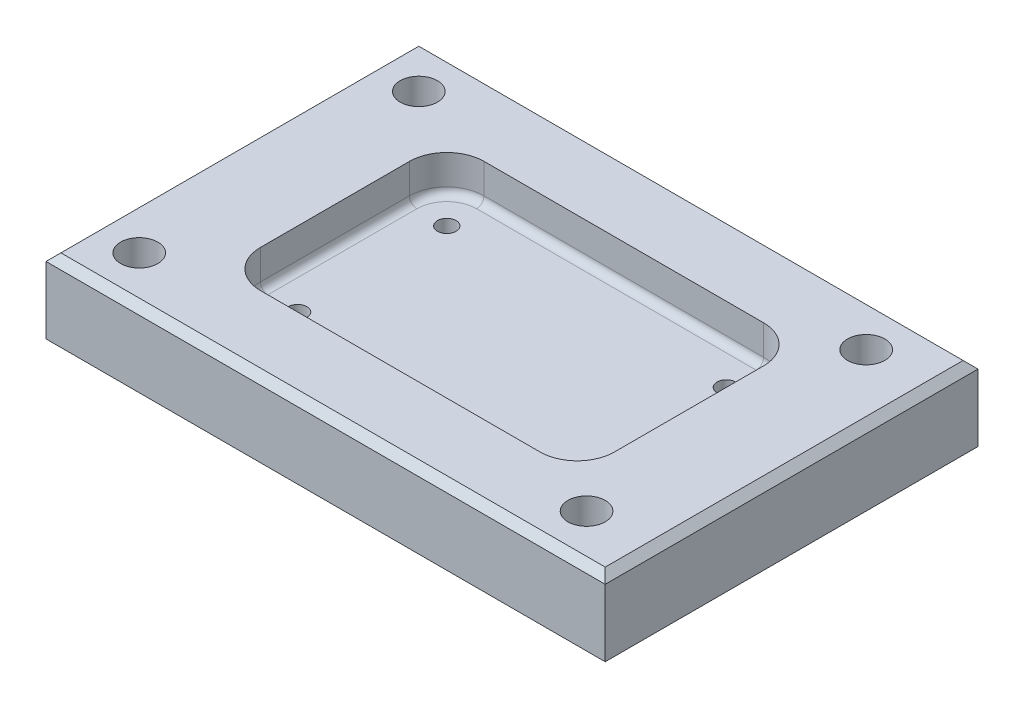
ISO-10303-21;
HEADER;
FILE_DESCRIPTION(('STEP AP214'),'2;1');
FILE_NAME('part.step','',(''),(''),'','','');
FILE_SCHEMA(('AUTOMOTIVE_DESIGN { 1 0 10303 214 1 1 1 1 }'));
ENDSEC;
DATA;
#1=APPLICATION_CONTEXT('core data for automotive mechanical design processes');
#2=APPLICATION_PROTOCOL_DEFINITION('international standard','automotive_design',2000,#1);
#3=PRODUCT_CONTEXT('',#1,'mechanical');
#4=PRODUCT('Part','Part','',(#3));
#5=PRODUCT_RELATED_PRODUCT_CATEGORY('part','',(#4));
#6=PRODUCT_DEFINITION_FORMATION('','',#4);
#7=PRODUCT_DEFINITION_CONTEXT('part definition',#1,'design');
#8=PRODUCT_DEFINITION('design','',#6,#7);
#9=PRODUCT_DEFINITION_SHAPE('','',#8);
#10=(LENGTH_UNIT() NAMED_UNIT(*) SI_UNIT(.MILLI.,.METRE.));
#11=(NAMED_UNIT(*) PLANE_ANGLE_UNIT() SI_UNIT($,.RADIAN.));
#12=(NAMED_UNIT(*) SI_UNIT($,.STERADIAN.) SOLID_ANGLE_UNIT());
#13=UNCERTAINTY_MEASURE_WITH_UNIT(LENGTH_MEASURE(1.E-05),#10,'distance_accuracy_value','');
#14=(GEOMETRIC_REPRESENTATION_CONTEXT(3) GLOBAL_UNCERTAINTY_ASSIGNED_CONTEXT((#13)) GLOBAL_UNIT_ASSIGNED_CONTEXT((#10,
#11,#12)) REPRESENTATION_CONTEXT('',''));
#15=CARTESIAN_POINT('',(0.,0.,0.));
#16=DIRECTION('',(0.,0.,1.));
#17=DIRECTION('',(1.,0.,0.));
#18=AXIS2_PLACEMENT_3D('',#15,#16,#17);
#19=CARTESIAN_POINT('',(-75.,20.,-50.));
#20=DIRECTION('',(1.,0.,0.));
#21=DIRECTION('',(0.,0.,-1.));
#22=AXIS2_PLACEMENT_3D('',#19,#20,#21);
#23=PLANE('',#22);
#24=DIRECTION('',(0.,-1.,0.));
#25=VECTOR('',#24,1.);
#26=CARTESIAN_POINT('',(-75.,20.,50.));
#27=LINE('',#26,#25);
#28=CARTESIAN_POINT('',(-75.,18.,50.));
#29=VERTEX_POINT('',#28);
#30=CARTESIAN_POINT('',(-75.,0.,50.));
#31=VERTEX_POINT('',#30);
#32=EDGE_CURVE('E233',#29,#31,#27,.T.);
#33=ORIENTED_EDGE('',*,*,#32,.F.);
#34=DIRECTION('',(0.,0.,-1.));
#35=VECTOR('',#34,1.);
#36=CARTESIAN_POINT('',(-75.,18.,-50.));
#37=LINE('',#36,#35);
#38=CARTESIAN_POINT('',(-75.,18.,-50.));
#39=VERTEX_POINT('',#38);
#40=EDGE_CURVE('E300',#29,#39,#37,.T.);
#41=ORIENTED_EDGE('',*,*,#40,.T.);
#42=DIRECTION('',(0.,-1.,0.));
#43=VECTOR('',#42,1.);
#44=CARTESIAN_POINT('',(-75.,20.,-50.));
#45=LINE('',#44,#43);
#46=CARTESIAN_POINT('',(-75.,0.,-50.));
#47=VERTEX_POINT('',#46);
#48=EDGE_CURVE('E227',#39,#47,#45,.T.);
#49=ORIENTED_EDGE('',*,*,#48,.T.);
#50=DIRECTION('',(0.,0.,1.));
#51=VECTOR('',#50,1.);
#52=CARTESIAN_POINT('',(-75.,0.,-50.));
#53=LINE('',#52,#51);
#54=EDGE_CURVE('E205',#47,#31,#53,.T.);
#55=ORIENTED_EDGE('',*,*,#54,.T.);
#56=EDGE_LOOP('',(#33,#41,#49,#55));
#57=FACE_BOUND('',#56,.T.);
#58=ADVANCED_FACE('F34',(#57),#23,.F.);
#59=CARTESIAN_POINT('',(-75.,20.,50.));
#60=DIRECTION('',(0.,0.,-1.));
#61=DIRECTION('',(-1.,0.,0.));
#62=AXIS2_PLACEMENT_3D('',#59,#60,#61);
#63=PLANE('',#62);
#64=DIRECTION('',(0.,-1.,0.));
#65=VECTOR('',#64,1.);
#66=CARTESIAN_POINT('',(75.,20.,50.));
#67=LINE('',#66,#65);
#68=CARTESIAN_POINT('',(75.,18.,50.));
#69=VERTEX_POINT('',#68);
#70=CARTESIAN_POINT('',(75.,0.,50.));
#71=VERTEX_POINT('',#70);
#72=EDGE_CURVE('E231',#69,#71,#67,.T.);
#73=ORIENTED_EDGE('',*,*,#72,.F.);
#74=DIRECTION('',(-1.,0.,0.));
#75=VECTOR('',#74,1.);
#76=CARTESIAN_POINT('',(-75.,18.,50.));
#77=LINE('',#76,#75);
#78=EDGE_CURVE('E11',#69,#29,#77,.T.);
#79=ORIENTED_EDGE('',*,*,#78,.T.);
#80=ORIENTED_EDGE('',*,*,#32,.T.);
#81=DIRECTION('',(1.,0.,0.));
#82=VECTOR('',#81,1.);
#83=CARTESIAN_POINT('',(-75.,0.,50.));
#84=LINE('',#83,#82);
#85=EDGE_CURVE('E218',#31,#71,#84,.T.);
#86=ORIENTED_EDGE('',*,*,#85,.T.);
#87=EDGE_LOOP('',(#73,#79,#80,#86));
#88=FACE_BOUND('',#87,.T.);
#89=ADVANCED_FACE('F436',(#88),#63,.F.);
#90=CARTESIAN_POINT('',(75.,20.,-50.));
#91=DIRECTION('',(-1.,0.,0.));
#92=DIRECTION('',(0.,0.,1.));
#93=AXIS2_PLACEMENT_3D('',#90,#91,#92);
#94=PLANE('',#93);
#95=DIRECTION('',(0.,-1.,0.));
#96=VECTOR('',#95,1.);
#97=CARTESIAN_POINT('',(75.,20.,-50.));
#98=LINE('',#97,#96);
#99=CARTESIAN_POINT('',(75.,18.,-50.));
#100=VERTEX_POINT('',#99);
#101=CARTESIAN_POINT('',(75.,0.,-50.));
#102=VERTEX_POINT('',#101);
#103=EDGE_CURVE('E229',#100,#102,#98,.T.);
#104=ORIENTED_EDGE('',*,*,#103,.F.);
#105=DIRECTION('',(0.,0.,1.));
#106=VECTOR('',#105,1.);
#107=CARTESIAN_POINT('',(75.,18.,50.));
#108=LINE('',#107,#106);
#109=EDGE_CURVE('E43',#100,#69,#108,.T.);
#110=ORIENTED_EDGE('',*,*,#109,.T.);
#111=ORIENTED_EDGE('',*,*,#72,.T.);
#112=DIRECTION('',(0.,0.,-1.));
#113=VECTOR('',#112,1.);
#114=CARTESIAN_POINT('',(75.,0.,-50.));
#115=LINE('',#114,#113);
#116=EDGE_CURVE('E221',#71,#102,#115,.T.);
#117=ORIENTED_EDGE('',*,*,#116,.T.);
#118=EDGE_LOOP('',(#104,#110,#111,#117));
#119=FACE_BOUND('',#118,.T.);
#120=ADVANCED_FACE('F442',(#119),#94,.F.);
#121=CARTESIAN_POINT('',(-75.,20.,-50.));
#122=DIRECTION('',(0.,0.,1.));
#123=DIRECTION('',(1.,0.,0.));
#124=AXIS2_PLACEMENT_3D('',#121,#122,#123);
#125=PLANE('',#124);
#126=ORIENTED_EDGE('',*,*,#48,.F.);
#127=DIRECTION('',(1.,0.,0.));
#128=VECTOR('',#127,1.);
#129=CARTESIAN_POINT('',(75.,18.,-50.));
#130=LINE('',#129,#128);
#131=EDGE_CURVE('E58',#39,#100,#130,.T.);
#132=ORIENTED_EDGE('',*,*,#131,.T.);
#133=ORIENTED_EDGE('',*,*,#103,.T.);
#134=DIRECTION('',(-1.,0.,0.));
#135=VECTOR('',#134,1.);
#136=CARTESIAN_POINT('',(-75.,0.,-50.));
#137=LINE('',#136,#135);
#138=EDGE_CURVE('E224',#102,#47,#137,.T.);
#139=ORIENTED_EDGE('',*,*,#138,.T.);
#140=EDGE_LOOP('',(#126,#132,#133,#139));
#141=FACE_BOUND('',#140,.T.);
#142=ADVANCED_FACE('F694',(#141),#125,.F.);
#143=CARTESIAN_POINT('',(-75.,20.,50.));
#144=DIRECTION('',(0.,1.,0.));
#145=DIRECTION('',(0.,0.,1.));
#146=AXIS2_PLACEMENT_3D('',#143,#144,#145);
#147=PLANE('',#146);
#148=DIRECTION('',(-1.,0.,0.));
#149=VECTOR('',#148,1.);
#150=CARTESIAN_POINT('',(-75.,20.,-48.));
#151=LINE('',#150,#149);
#152=CARTESIAN_POINT('',(73.,20.,-48.));
#153=VERTEX_POINT('',#152);
#154=CARTESIAN_POINT('',(-73.,20.,-48.));
#155=VERTEX_POINT('',#154);
#156=EDGE_CURVE('E295',#153,#155,#151,.T.);
#157=ORIENTED_EDGE('',*,*,#156,.T.);
#158=DIRECTION('',(0.,0.,1.));
#159=VECTOR('',#158,1.);
#160=CARTESIAN_POINT('',(-73.,20.,50.));
#161=LINE('',#160,#159);
#162=CARTESIAN_POINT('',(-73.,20.,48.));
#163=VERTEX_POINT('',#162);
#164=EDGE_CURVE('E297',#155,#163,#161,.T.);
#165=ORIENTED_EDGE('',*,*,#164,.T.);
#166=DIRECTION('',(1.,0.,0.));
#167=VECTOR('',#166,1.);
#168=CARTESIAN_POINT('',(75.,20.,48.));
#169=LINE('',#168,#167);
#170=CARTESIAN_POINT('',(73.,20.,48.));
#171=VERTEX_POINT('',#170);
#172=EDGE_CURVE('E268',#163,#171,#169,.T.);
#173=ORIENTED_EDGE('',*,*,#172,.T.);
#174=DIRECTION('',(0.,0.,-1.));
#175=VECTOR('',#174,1.);
#176=CARTESIAN_POINT('',(73.,20.,-50.));
#177=LINE('',#176,#175);
#178=EDGE_CURVE('E293',#171,#153,#177,.T.);
#179=ORIENTED_EDGE('',*,*,#178,.T.);
#180=EDGE_LOOP('',(#157,#165,#173,#179));
#181=FACE_BOUND('',#180,.T.);
#182=CARTESIAN_POINT('',(57.5,20.,-37.5));
#183=DIRECTION('',(0.,1.,0.));
#184=DIRECTION('',(0.,0.,1.));
#185=AXIS2_PLACEMENT_3D('',#182,#183,#184);
#186=CIRCLE('',#185,5.00000000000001);
#187=CARTESIAN_POINT('',(57.5,20.,-32.5));
#188=VERTEX_POINT('',#187);
#189=EDGE_CURVE('E315',#188,#188,#186,.T.);
#190=ORIENTED_EDGE('',*,*,#189,.F.);
#191=EDGE_LOOP('',(#190));
#192=FACE_BOUND('',#191,.T.);
#193=CARTESIAN_POINT('',(-62.5,20.,-37.5));
#194=DIRECTION('',(0.,1.,0.));
#195=DIRECTION('',(0.,0.,1.));
#196=AXIS2_PLACEMENT_3D('',#193,#194,#195);
#197=CIRCLE('',#196,5.00000000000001);
#198=CARTESIAN_POINT('',(-62.5,20.,-32.5));
#199=VERTEX_POINT('',#198);
#200=EDGE_CURVE('E325',#199,#199,#197,.T.);
#201=ORIENTED_EDGE('',*,*,#200,.F.);
#202=EDGE_LOOP('',(#201));
#203=FACE_BOUND('',#202,.T.);
#204=CARTESIAN_POINT('',(57.5,20.,37.5));
#205=DIRECTION('',(0.,1.,0.));
#206=DIRECTION('',(0.,0.,1.));
#207=AXIS2_PLACEMENT_3D('',#204,#205,#206);
#208=CIRCLE('',#207,5.00000000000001);
#209=CARTESIAN_POINT('',(57.5,20.,42.5));
#210=VERTEX_POINT('',#209);
#211=EDGE_CURVE('E331',#210,#210,#208,.T.);
#212=ORIENTED_EDGE('',*,*,#211,.F.);
#213=EDGE_LOOP('',(#212));
#214=FACE_BOUND('',#213,.T.);
#215=CARTESIAN_POINT('',(-62.5,20.,37.5));
#216=DIRECTION('',(0.,1.,0.));
#217=DIRECTION('',(0.,0.,1.));
#218=AXIS2_PLACEMENT_3D('',#215,#216,#217);
#219=CIRCLE('',#218,5.00000000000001);
#220=CARTESIAN_POINT('',(-62.5,20.,42.5));
#221=VERTEX_POINT('',#220);
#222=EDGE_CURVE('E337',#221,#221,#219,.T.);
#223=ORIENTED_EDGE('',*,*,#222,.F.);
#224=EDGE_LOOP('',(#223));
#225=FACE_BOUND('',#224,.T.);
#226=CARTESIAN_POINT('',(-37.5,20.,20.));
#227=DIRECTION('',(0.,1.,0.));
#228=DIRECTION('',(0.,0.,-1.));
#229=AXIS2_PLACEMENT_3D('',#226,#227,#228);
#230=CIRCLE('',#229,10.);
#231=CARTESIAN_POINT('',(-47.5,20.,19.9999999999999));
#232=VERTEX_POINT('',#231);
#233=CARTESIAN_POINT('',(-37.4999999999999,20.,30.));
#234=VERTEX_POINT('',#233);
#235=EDGE_CURVE('E181',#232,#234,#230,.T.);
#236=ORIENTED_EDGE('',*,*,#235,.F.);
#237=DIRECTION('',(0.,0.,1.));
#238=VECTOR('',#237,1.);
#239=CARTESIAN_POINT('',(-47.5,20.,19.9999999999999));
#240=LINE('',#239,#238);
#241=CARTESIAN_POINT('',(-47.5,20.,-19.9999999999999));
#242=VERTEX_POINT('',#241);
#243=EDGE_CURVE('E200',#242,#232,#240,.T.);
#244=ORIENTED_EDGE('',*,*,#243,.F.);
#245=CARTESIAN_POINT('',(-37.5,20.,-20.));
#246=DIRECTION('',(0.,1.,0.));
#247=DIRECTION('',(0.,0.,1.));
#248=AXIS2_PLACEMENT_3D('',#245,#246,#247);
#249=CIRCLE('',#248,10.);
#250=CARTESIAN_POINT('',(-37.4999999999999,20.,-30.));
#251=VERTEX_POINT('',#250);
#252=EDGE_CURVE('E197',#251,#242,#249,.T.);
#253=ORIENTED_EDGE('',*,*,#252,.F.);
#254=DIRECTION('',(-1.,0.,0.));
#255=VECTOR('',#254,1.);
#256=CARTESIAN_POINT('',(37.4999999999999,20.,-30.));
#257=LINE('',#256,#255);
#258=CARTESIAN_POINT('',(37.4999999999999,20.,-30.));
#259=VERTEX_POINT('',#258);
#260=EDGE_CURVE('E194',#259,#251,#257,.T.);
#261=ORIENTED_EDGE('',*,*,#260,.F.);
#262=CARTESIAN_POINT('',(37.5,20.,-20.));
#263=DIRECTION('',(0.,1.,0.));
#264=DIRECTION('',(0.,0.,1.));
#265=AXIS2_PLACEMENT_3D('',#262,#263,#264);
#266=CIRCLE('',#265,10.);
#267=CARTESIAN_POINT('',(47.5,20.,-19.9999999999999));
#268=VERTEX_POINT('',#267);
#269=EDGE_CURVE('E188',#268,#259,#266,.T.);
#270=ORIENTED_EDGE('',*,*,#269,.F.);
#271=DIRECTION('',(0.,0.,-1.));
#272=VECTOR('',#271,1.);
#273=CARTESIAN_POINT('',(47.5,20.,19.9999999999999));
#274=LINE('',#273,#272);
#275=CARTESIAN_POINT('',(47.5,20.,19.9999999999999));
#276=VERTEX_POINT('',#275);
#277=EDGE_CURVE('E186',#276,#268,#274,.T.);
#278=ORIENTED_EDGE('',*,*,#277,.F.);
#279=CARTESIAN_POINT('',(37.5,20.,20.));
#280=DIRECTION('',(0.,1.,0.));
#281=DIRECTION('',(0.,0.,1.));
#282=AXIS2_PLACEMENT_3D('',#279,#280,#281);
#283=CIRCLE('',#282,10.);
#284=CARTESIAN_POINT('',(37.4999999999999,20.,30.));
#285=VERTEX_POINT('',#284);
#286=EDGE_CURVE('E165',#285,#276,#283,.T.);
#287=ORIENTED_EDGE('',*,*,#286,.F.);
#288=DIRECTION('',(1.,0.,0.));
#289=VECTOR('',#288,1.);
#290=CARTESIAN_POINT('',(37.4999999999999,20.,30.));
#291=LINE('',#290,#289);
#292=EDGE_CURVE('E175',#234,#285,#291,.T.);
#293=ORIENTED_EDGE('',*,*,#292,.F.);
#294=EDGE_LOOP('',(#236,#244,#253,#261,#270,#278,#287,#293));
#295=FACE_BOUND('',#294,.T.);
#296=ADVANCED_FACE('F183',(#181,#192,#203,#214,#225,#295),#147,.T.);
#297=CARTESIAN_POINT('',(-75.,0.,50.));
#298=DIRECTION('',(0.,1.,0.));
#299=DIRECTION('',(0.,0.,1.));
#300=AXIS2_PLACEMENT_3D('',#297,#298,#299);
#301=PLANE('',#300);
#302=CARTESIAN_POINT('',(57.5,0.,-37.5));
#303=DIRECTION('',(0.,1.,0.));
#304=DIRECTION('',(0.,0.,1.));
#305=AXIS2_PLACEMENT_3D('',#302,#303,#304);
#306=CIRCLE('',#305,5.00000000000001);
#307=CARTESIAN_POINT('',(57.5,0.,-32.5));
#308=VERTEX_POINT('',#307);
#309=EDGE_CURVE('E320',#308,#308,#306,.T.);
#310=ORIENTED_EDGE('',*,*,#309,.T.);
#311=EDGE_LOOP('',(#310));
#312=FACE_BOUND('',#311,.T.);
#313=CARTESIAN_POINT('',(-62.5,0.,-37.5));
#314=DIRECTION('',(0.,1.,0.));
#315=DIRECTION('',(0.,0.,1.));
#316=AXIS2_PLACEMENT_3D('',#313,#314,#315);
#317=CIRCLE('',#316,5.00000000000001);
#318=CARTESIAN_POINT('',(-62.5,0.,-32.5));
#319=VERTEX_POINT('',#318);
#320=EDGE_CURVE('E328',#319,#319,#317,.T.);
#321=ORIENTED_EDGE('',*,*,#320,.T.);
#322=EDGE_LOOP('',(#321));
#323=FACE_BOUND('',#322,.T.);
#324=CARTESIAN_POINT('',(57.5,0.,37.5));
#325=DIRECTION('',(0.,1.,0.));
#326=DIRECTION('',(0.,0.,1.));
#327=AXIS2_PLACEMENT_3D('',#324,#325,#326);
#328=CIRCLE('',#327,5.00000000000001);
#329=CARTESIAN_POINT('',(57.5,0.,42.5));
#330=VERTEX_POINT('',#329);
#331=EDGE_CURVE('E334',#330,#330,#328,.T.);
#332=ORIENTED_EDGE('',*,*,#331,.T.);
#333=EDGE_LOOP('',(#332));
#334=FACE_BOUND('',#333,.T.);
#335=CARTESIAN_POINT('',(-62.5,0.,37.5));
#336=DIRECTION('',(0.,1.,0.));
#337=DIRECTION('',(0.,0.,1.));
#338=AXIS2_PLACEMENT_3D('',#335,#336,#337);
#339=CIRCLE('',#338,5.00000000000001);
#340=CARTESIAN_POINT('',(-62.5,0.,42.5));
#341=VERTEX_POINT('',#340);
#342=EDGE_CURVE('E340',#341,#341,#339,.T.);
#343=ORIENTED_EDGE('',*,*,#342,.T.);
#344=EDGE_LOOP('',(#343));
#345=FACE_BOUND('',#344,.T.);
#346=CARTESIAN_POINT('',(-37.5,0.,-20.));
#347=DIRECTION('',(0.,1.,0.));
#348=DIRECTION('',(0.,0.,1.));
#349=AXIS2_PLACEMENT_3D('',#346,#347,#348);
#350=CIRCLE('',#349,2.5);
#351=CARTESIAN_POINT('',(-37.5,0.,-17.5));
#352=VERTEX_POINT('',#351);
#353=EDGE_CURVE('E346',#352,#352,#350,.T.);
#354=ORIENTED_EDGE('',*,*,#353,.T.);
#355=EDGE_LOOP('',(#354));
#356=FACE_BOUND('',#355,.T.);
#357=CARTESIAN_POINT('',(-37.5,0.,20.));
#358=DIRECTION('',(0.,1.,0.));
#359=DIRECTION('',(0.,0.,1.));
#360=AXIS2_PLACEMENT_3D('',#357,#358,#359);
#361=CIRCLE('',#360,2.5);
#362=CARTESIAN_POINT('',(-37.5,0.,22.5));
#363=VERTEX_POINT('',#362);
#364=EDGE_CURVE('E352',#363,#363,#361,.T.);
#365=ORIENTED_EDGE('',*,*,#364,.T.);
#366=EDGE_LOOP('',(#365));
#367=FACE_BOUND('',#366,.T.);
#368=CARTESIAN_POINT('',(37.5,0.,-20.));
#369=DIRECTION('',(0.,1.,0.));
#370=DIRECTION('',(0.,0.,1.));
#371=AXIS2_PLACEMENT_3D('',#368,#369,#370);
#372=CIRCLE('',#371,2.5);
#373=CARTESIAN_POINT('',(37.5,0.,-17.5));
#374=VERTEX_POINT('',#373);
#375=EDGE_CURVE('E358',#374,#374,#372,.T.);
#376=ORIENTED_EDGE('',*,*,#375,.T.);
#377=EDGE_LOOP('',(#376));
#378=FACE_BOUND('',#377,.T.);
#379=CARTESIAN_POINT('',(37.5,0.,20.));
#380=DIRECTION('',(0.,1.,0.));
#381=DIRECTION('',(0.,0.,1.));
#382=AXIS2_PLACEMENT_3D('',#379,#380,#381);
#383=CIRCLE('',#382,2.5);
#384=CARTESIAN_POINT('',(37.5,0.,22.5));
#385=VERTEX_POINT('',#384);
#386=EDGE_CURVE('E272',#385,#385,#383,.T.);
#387=ORIENTED_EDGE('',*,*,#386,.T.);
#388=EDGE_LOOP('',(#387));
#389=FACE_BOUND('',#388,.T.);
#390=ORIENTED_EDGE('',*,*,#54,.F.);
#391=ORIENTED_EDGE('',*,*,#138,.F.);
#392=ORIENTED_EDGE('',*,*,#116,.F.);
#393=ORIENTED_EDGE('',*,*,#85,.F.);
#394=EDGE_LOOP('',(#390,#391,#392,#393));
#395=FACE_BOUND('',#394,.T.);
#396=ADVANCED_FACE('F680',(#312,#323,#334,#345,#356,#367,#378,#389,#395),#301,.F.);
#397=CARTESIAN_POINT('',(-37.5,10.,20.));
#398=DIRECTION('',(0.,1.,0.));
#399=DIRECTION('',(0.,0.,1.));
#400=AXIS2_PLACEMENT_3D('',#397,#398,#399);
#401=CYLINDRICAL_SURFACE('',#400,10.);
#402=DIRECTION('',(0.,1.,0.));
#403=VECTOR('',#402,1.);
#404=CARTESIAN_POINT('',(-37.4999999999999,10.,30.));
#405=LINE('',#404,#403);
#406=CARTESIAN_POINT('',(-37.4999999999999,12.,30.));
#407=VERTEX_POINT('',#406);
#408=EDGE_CURVE('E172',#407,#234,#405,.T.);
#409=ORIENTED_EDGE('',*,*,#408,.F.);
#410=CARTESIAN_POINT('',(-37.5,12.,20.));
#411=DIRECTION('',(0.,-1.,0.));
#412=DIRECTION('',(0.,0.,-1.));
#413=AXIS2_PLACEMENT_3D('',#410,#411,#412);
#414=CIRCLE('',#413,10.);
#415=CARTESIAN_POINT('',(-47.5,12.,19.9999999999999));
#416=VERTEX_POINT('',#415);
#417=EDGE_CURVE('E264',#407,#416,#414,.T.);
#418=ORIENTED_EDGE('',*,*,#417,.T.);
#419=DIRECTION('',(0.,1.,0.));
#420=VECTOR('',#419,1.);
#421=CARTESIAN_POINT('',(-47.5,10.,19.9999999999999));
#422=LINE('',#421,#420);
#423=EDGE_CURVE('E203',#416,#232,#422,.T.);
#424=ORIENTED_EDGE('',*,*,#423,.T.);
#425=ORIENTED_EDGE('',*,*,#235,.T.);
#426=EDGE_LOOP('',(#409,#418,#424,#425));
#427=FACE_BOUND('',#426,.T.);
#428=ADVANCED_FACE('F368',(#427),#401,.F.);
#429=CARTESIAN_POINT('',(-47.5,10.,19.9999999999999));
#430=DIRECTION('',(-1.,0.,0.));
#431=DIRECTION('',(0.,0.,1.));
#432=AXIS2_PLACEMENT_3D('',#429,#430,#431);
#433=PLANE('',#432);
#434=ORIENTED_EDGE('',*,*,#423,.F.);
#435=DIRECTION('',(0.,0.,1.));
#436=VECTOR('',#435,1.);
#437=CARTESIAN_POINT('',(-47.5,12.,-19.9999999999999));
#438=LINE('',#437,#436);
#439=CARTESIAN_POINT('',(-47.5,12.,-19.9999999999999));
#440=VERTEX_POINT('',#439);
#441=EDGE_CURVE('E266',#416,#440,#438,.F.);
#442=ORIENTED_EDGE('',*,*,#441,.T.);
#443=DIRECTION('',(0.,1.,0.));
#444=VECTOR('',#443,1.);
#445=CARTESIAN_POINT('',(-47.5,10.,-19.9999999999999));
#446=LINE('',#445,#444);
#447=EDGE_CURVE('E206',#440,#242,#446,.T.);
#448=ORIENTED_EDGE('',*,*,#447,.T.);
#449=ORIENTED_EDGE('',*,*,#243,.T.);
#450=EDGE_LOOP('',(#434,#442,#448,#449));
#451=FACE_BOUND('',#450,.T.);
#452=ADVANCED_FACE('F375',(#451),#433,.F.);
#453=CARTESIAN_POINT('',(-37.5,10.,-20.));
#454=DIRECTION('',(0.,1.,0.));
#455=DIRECTION('',(0.,0.,1.));
#456=AXIS2_PLACEMENT_3D('',#453,#454,#455);
#457=CYLINDRICAL_SURFACE('',#456,10.);
#458=ORIENTED_EDGE('',*,*,#447,.F.);
#459=CARTESIAN_POINT('',(-37.5,12.,-20.));
#460=DIRECTION('',(0.,-1.,0.));
#461=DIRECTION('',(0.,0.,-1.));
#462=AXIS2_PLACEMENT_3D('',#459,#460,#461);
#463=CIRCLE('',#462,10.);
#464=CARTESIAN_POINT('',(-37.4999999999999,12.,-30.));
#465=VERTEX_POINT('',#464);
#466=EDGE_CURVE('E252',#440,#465,#463,.T.);
#467=ORIENTED_EDGE('',*,*,#466,.T.);
#468=DIRECTION('',(0.,1.,0.));
#469=VECTOR('',#468,1.);
#470=CARTESIAN_POINT('',(-37.4999999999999,10.,-30.));
#471=LINE('',#470,#469);
#472=EDGE_CURVE('E208',#465,#251,#471,.T.);
#473=ORIENTED_EDGE('',*,*,#472,.T.);
#474=ORIENTED_EDGE('',*,*,#252,.T.);
#475=EDGE_LOOP('',(#458,#467,#473,#474));
#476=FACE_BOUND('',#475,.T.);
#477=ADVANCED_FACE('F381',(#476),#457,.F.);
#478=CARTESIAN_POINT('',(37.4999999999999,10.,-30.));
#479=DIRECTION('',(0.,0.,-1.));
#480=DIRECTION('',(-1.,0.,0.));
#481=AXIS2_PLACEMENT_3D('',#478,#479,#480);
#482=PLANE('',#481);
#483=ORIENTED_EDGE('',*,*,#472,.F.);
#484=DIRECTION('',(-1.,0.,0.));
#485=VECTOR('',#484,1.);
#486=CARTESIAN_POINT('',(37.4999999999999,12.,-30.));
#487=LINE('',#486,#485);
#488=CARTESIAN_POINT('',(37.4999999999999,12.,-30.));
#489=VERTEX_POINT('',#488);
#490=EDGE_CURVE('E255',#465,#489,#487,.F.);
#491=ORIENTED_EDGE('',*,*,#490,.T.);
#492=DIRECTION('',(0.,1.,0.));
#493=VECTOR('',#492,1.);
#494=CARTESIAN_POINT('',(37.4999999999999,10.,-30.));
#495=LINE('',#494,#493);
#496=EDGE_CURVE('E210',#489,#259,#495,.T.);
#497=ORIENTED_EDGE('',*,*,#496,.T.);
#498=ORIENTED_EDGE('',*,*,#260,.T.);
#499=EDGE_LOOP('',(#483,#491,#497,#498));
#500=FACE_BOUND('',#499,.T.);
#501=ADVANCED_FACE('F384',(#500),#482,.F.);
#502=CARTESIAN_POINT('',(37.5,10.,-20.));
#503=DIRECTION('',(0.,1.,0.));
#504=DIRECTION('',(0.,0.,1.));
#505=AXIS2_PLACEMENT_3D('',#502,#503,#504);
#506=CYLINDRICAL_SURFACE('',#505,10.);
#507=ORIENTED_EDGE('',*,*,#496,.F.);
#508=CARTESIAN_POINT('',(37.5,12.,-20.));
#509=DIRECTION('',(0.,-1.,0.));
#510=DIRECTION('',(0.,0.,-1.));
#511=AXIS2_PLACEMENT_3D('',#508,#509,#510);
#512=CIRCLE('',#511,10.);
#513=CARTESIAN_POINT('',(47.5,12.,-19.9999999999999));
#514=VERTEX_POINT('',#513);
#515=EDGE_CURVE('E257',#489,#514,#512,.T.);
#516=ORIENTED_EDGE('',*,*,#515,.T.);
#517=DIRECTION('',(0.,1.,0.));
#518=VECTOR('',#517,1.);
#519=CARTESIAN_POINT('',(47.5,10.,-19.9999999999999));
#520=LINE('',#519,#518);
#521=EDGE_CURVE('E212',#514,#268,#520,.T.);
#522=ORIENTED_EDGE('',*,*,#521,.T.);
#523=ORIENTED_EDGE('',*,*,#269,.T.);
#524=EDGE_LOOP('',(#507,#516,#522,#523));
#525=FACE_BOUND('',#524,.T.);
#526=ADVANCED_FACE('F387',(#525),#506,.F.);
#527=CARTESIAN_POINT('',(47.5,10.,19.9999999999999));
#528=DIRECTION('',(1.,0.,0.));
#529=DIRECTION('',(0.,0.,-1.));
#530=AXIS2_PLACEMENT_3D('',#527,#528,#529);
#531=PLANE('',#530);
#532=ORIENTED_EDGE('',*,*,#521,.F.);
#533=DIRECTION('',(0.,0.,-1.));
#534=VECTOR('',#533,1.);
#535=CARTESIAN_POINT('',(47.5,12.,19.9999999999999));
#536=LINE('',#535,#534);
#537=CARTESIAN_POINT('',(47.5,12.,19.9999999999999));
#538=VERTEX_POINT('',#537);
#539=EDGE_CURVE('E259',#514,#538,#536,.F.);
#540=ORIENTED_EDGE('',*,*,#539,.T.);
#541=DIRECTION('',(0.,1.,0.));
#542=VECTOR('',#541,1.);
#543=CARTESIAN_POINT('',(47.5,10.,19.9999999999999));
#544=LINE('',#543,#542);
#545=EDGE_CURVE('E171',#538,#276,#544,.T.);
#546=ORIENTED_EDGE('',*,*,#545,.T.);
#547=ORIENTED_EDGE('',*,*,#277,.T.);
#548=EDGE_LOOP('',(#532,#540,#546,#547));
#549=FACE_BOUND('',#548,.T.);
#550=ADVANCED_FACE('F392',(#549),#531,.F.);
#551=CARTESIAN_POINT('',(37.5,10.,20.));
#552=DIRECTION('',(0.,1.,0.));
#553=DIRECTION('',(0.,0.,1.));
#554=AXIS2_PLACEMENT_3D('',#551,#552,#553);
#555=CYLINDRICAL_SURFACE('',#554,10.);
#556=ORIENTED_EDGE('',*,*,#545,.F.);
#557=CARTESIAN_POINT('',(37.5,12.,20.));
#558=DIRECTION('',(0.,-1.,0.));
#559=DIRECTION('',(0.,0.,-1.));
#560=AXIS2_PLACEMENT_3D('',#557,#558,#559);
#561=CIRCLE('',#560,10.);
#562=CARTESIAN_POINT('',(37.4999999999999,12.,30.));
#563=VERTEX_POINT('',#562);
#564=EDGE_CURVE('E168',#538,#563,#561,.T.);
#565=ORIENTED_EDGE('',*,*,#564,.T.);
#566=DIRECTION('',(0.,1.,0.));
#567=VECTOR('',#566,1.);
#568=CARTESIAN_POINT('',(37.4999999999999,10.,30.));
#569=LINE('',#568,#567);
#570=EDGE_CURVE('E160',#563,#285,#569,.T.);
#571=ORIENTED_EDGE('',*,*,#570,.T.);
#572=ORIENTED_EDGE('',*,*,#286,.T.);
#573=EDGE_LOOP('',(#556,#565,#571,#572));
#574=FACE_BOUND('',#573,.T.);
#575=ADVANCED_FACE('F163',(#574),#555,.F.);
#576=CARTESIAN_POINT('',(37.4999999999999,10.,30.));
#577=DIRECTION('',(0.,0.,1.));
#578=DIRECTION('',(1.,0.,0.));
#579=AXIS2_PLACEMENT_3D('',#576,#577,#578);
#580=PLANE('',#579);
#581=ORIENTED_EDGE('',*,*,#570,.F.);
#582=DIRECTION('',(1.,0.,0.));
#583=VECTOR('',#582,1.);
#584=CARTESIAN_POINT('',(-37.4999999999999,12.,30.));
#585=LINE('',#584,#583);
#586=EDGE_CURVE('E262',#563,#407,#585,.F.);
#587=ORIENTED_EDGE('',*,*,#586,.T.);
#588=ORIENTED_EDGE('',*,*,#408,.T.);
#589=ORIENTED_EDGE('',*,*,#292,.T.);
#590=EDGE_LOOP('',(#581,#587,#588,#589));
#591=FACE_BOUND('',#590,.T.);
#592=ADVANCED_FACE('F176',(#591),#580,.F.);
#593=CARTESIAN_POINT('',(-37.5,10.,20.));
#594=DIRECTION('',(0.,-1.,0.));
#595=DIRECTION('',(0.,0.,-1.));
#596=AXIS2_PLACEMENT_3D('',#593,#594,#595);
#597=PLANE('',#596);
#598=CARTESIAN_POINT('',(-37.5,10.,-20.));
#599=DIRECTION('',(0.,1.,0.));
#600=DIRECTION('',(0.,0.,1.));
#601=AXIS2_PLACEMENT_3D('',#598,#599,#600);
#602=CIRCLE('',#601,2.5);
#603=CARTESIAN_POINT('',(-37.5,10.,-17.5));
#604=VERTEX_POINT('',#603);
#605=EDGE_CURVE('E343',#604,#604,#602,.T.);
#606=ORIENTED_EDGE('',*,*,#605,.F.);
#607=EDGE_LOOP('',(#606));
#608=FACE_BOUND('',#607,.T.);
#609=CARTESIAN_POINT('',(-37.5,10.,20.));
#610=DIRECTION('',(0.,1.,0.));
#611=DIRECTION('',(0.,0.,1.));
#612=AXIS2_PLACEMENT_3D('',#609,#610,#611);
#613=CIRCLE('',#612,2.5);
#614=CARTESIAN_POINT('',(-37.5,10.,22.5));
#615=VERTEX_POINT('',#614);
#616=EDGE_CURVE('E349',#615,#615,#613,.T.);
#617=ORIENTED_EDGE('',*,*,#616,.F.);
#618=EDGE_LOOP('',(#617));
#619=FACE_BOUND('',#618,.T.);
#620=CARTESIAN_POINT('',(37.5,10.,-20.));
#621=DIRECTION('',(0.,1.,0.));
#622=DIRECTION('',(0.,0.,1.));
#623=AXIS2_PLACEMENT_3D('',#620,#621,#622);
#624=CIRCLE('',#623,2.5);
#625=CARTESIAN_POINT('',(37.5,10.,-17.5));
#626=VERTEX_POINT('',#625);
#627=EDGE_CURVE('E355',#626,#626,#624,.T.);
#628=ORIENTED_EDGE('',*,*,#627,.F.);
#629=EDGE_LOOP('',(#628));
#630=FACE_BOUND('',#629,.T.);
#631=CARTESIAN_POINT('',(37.5,10.,20.));
#632=DIRECTION('',(0.,1.,0.));
#633=DIRECTION('',(0.,0.,1.));
#634=AXIS2_PLACEMENT_3D('',#631,#632,#633);
#635=CIRCLE('',#634,2.5);
#636=CARTESIAN_POINT('',(37.5,10.,22.5));
#637=VERTEX_POINT('',#636);
#638=EDGE_CURVE('E361',#637,#637,#635,.T.);
#639=ORIENTED_EDGE('',*,*,#638,.F.);
#640=EDGE_LOOP('',(#639));
#641=FACE_BOUND('',#640,.T.);
#642=DIRECTION('',(-1.,0.,0.));
#643=VECTOR('',#642,1.);
#644=CARTESIAN_POINT('',(-37.4999999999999,10.,-28.));
#645=LINE('',#644,#643);
#646=CARTESIAN_POINT('',(37.4999999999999,10.,-28.));
#647=VERTEX_POINT('',#646);
#648=CARTESIAN_POINT('',(-37.5,10.,-28.));
#649=VERTEX_POINT('',#648);
#650=EDGE_CURVE('E247',#647,#649,#645,.T.);
#651=ORIENTED_EDGE('',*,*,#650,.T.);
#652=CARTESIAN_POINT('',(-37.5,10.,-20.));
#653=DIRECTION('',(0.,-1.,0.));
#654=DIRECTION('',(0.,0.,-1.));
#655=AXIS2_PLACEMENT_3D('',#652,#653,#654);
#656=CIRCLE('',#655,8.);
#657=CARTESIAN_POINT('',(-45.5,10.,-19.9999999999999));
#658=VERTEX_POINT('',#657);
#659=EDGE_CURVE('E249',#649,#658,#656,.F.);
#660=ORIENTED_EDGE('',*,*,#659,.T.);
#661=DIRECTION('',(0.,0.,1.));
#662=VECTOR('',#661,1.);
#663=CARTESIAN_POINT('',(-45.5,10.,19.9999999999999));
#664=LINE('',#663,#662);
#665=CARTESIAN_POINT('',(-45.5,10.,19.9999999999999));
#666=VERTEX_POINT('',#665);
#667=EDGE_CURVE('E235',#658,#666,#664,.T.);
#668=ORIENTED_EDGE('',*,*,#667,.T.);
#669=CARTESIAN_POINT('',(-37.5,10.,20.));
#670=DIRECTION('',(0.,-1.,0.));
#671=DIRECTION('',(0.,0.,-1.));
#672=AXIS2_PLACEMENT_3D('',#669,#670,#671);
#673=CIRCLE('',#672,8.);
#674=CARTESIAN_POINT('',(-37.4999999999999,10.,28.));
#675=VERTEX_POINT('',#674);
#676=EDGE_CURVE('E237',#666,#675,#673,.F.);
#677=ORIENTED_EDGE('',*,*,#676,.T.);
#678=DIRECTION('',(1.,0.,0.));
#679=VECTOR('',#678,1.);
#680=CARTESIAN_POINT('',(37.4999999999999,10.,28.));
#681=LINE('',#680,#679);
#682=CARTESIAN_POINT('',(37.4999999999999,10.,28.));
#683=VERTEX_POINT('',#682);
#684=EDGE_CURVE('E239',#675,#683,#681,.T.);
#685=ORIENTED_EDGE('',*,*,#684,.T.);
#686=CARTESIAN_POINT('',(37.5,10.,20.));
#687=DIRECTION('',(0.,-1.,0.));
#688=DIRECTION('',(0.,0.,-1.));
#689=AXIS2_PLACEMENT_3D('',#686,#687,#688);
#690=CIRCLE('',#689,8.);
#691=CARTESIAN_POINT('',(45.5,10.,19.9999999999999));
#692=VERTEX_POINT('',#691);
#693=EDGE_CURVE('E241',#683,#692,#690,.F.);
#694=ORIENTED_EDGE('',*,*,#693,.T.);
#695=DIRECTION('',(0.,0.,-1.));
#696=VECTOR('',#695,1.);
#697=CARTESIAN_POINT('',(45.5,10.,-19.9999999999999));
#698=LINE('',#697,#696);
#699=CARTESIAN_POINT('',(45.5,10.,-19.9999999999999));
#700=VERTEX_POINT('',#699);
#701=EDGE_CURVE('E243',#692,#700,#698,.T.);
#702=ORIENTED_EDGE('',*,*,#701,.T.);
#703=CARTESIAN_POINT('',(37.5,10.,-20.));
#704=DIRECTION('',(0.,-1.,0.));
#705=DIRECTION('',(0.,0.,-1.));
#706=AXIS2_PLACEMENT_3D('',#703,#704,#705);
#707=CIRCLE('',#706,8.);
#708=EDGE_CURVE('E245',#700,#647,#707,.F.);
#709=ORIENTED_EDGE('',*,*,#708,.T.);
#710=EDGE_LOOP('',(#651,#660,#668,#677,#685,#694,#702,#709));
#711=FACE_BOUND('',#710,.T.);
#712=ADVANCED_FACE('F404',(#608,#619,#630,#641,#711),#597,.F.);
#713=CARTESIAN_POINT('',(37.5,12.,20.));
#714=DIRECTION('',(0.,-1.,0.));
#715=DIRECTION('',(0.,0.,-1.));
#716=AXIS2_PLACEMENT_3D('',#713,#714,#715);
#717=TOROIDAL_SURFACE('',#716,8.,2.);
#718=CARTESIAN_POINT('',(37.4999999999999,12.,28.));
#719=DIRECTION('',(1.,0.,0.));
#720=DIRECTION('',(0.,0.,-1.));
#721=AXIS2_PLACEMENT_3D('',#718,#719,#720);
#722=CIRCLE('',#721,2.);
#723=EDGE_CURVE('E286',#563,#683,#722,.T.);
#724=ORIENTED_EDGE('',*,*,#723,.F.);
#725=ORIENTED_EDGE('',*,*,#564,.F.);
#726=CARTESIAN_POINT('',(45.5,12.,19.9999999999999));
#727=DIRECTION('',(0.,0.,1.));
#728=DIRECTION('',(1.,0.,0.));
#729=AXIS2_PLACEMENT_3D('',#726,#727,#728);
#730=CIRCLE('',#729,2.);
#731=EDGE_CURVE('E289',#692,#538,#730,.T.);
#732=ORIENTED_EDGE('',*,*,#731,.F.);
#733=ORIENTED_EDGE('',*,*,#693,.F.);
#734=EDGE_LOOP('',(#724,#725,#732,#733));
#735=FACE_BOUND('',#734,.T.);
#736=ADVANCED_FACE('F395',(#735),#717,.F.);
#737=CARTESIAN_POINT('',(45.5,12.,20.));
#738=DIRECTION('',(0.,0.,1.));
#739=DIRECTION('',(1.,0.,0.));
#740=AXIS2_PLACEMENT_3D('',#737,#738,#739);
#741=CYLINDRICAL_SURFACE('',#740,2.);
#742=ORIENTED_EDGE('',*,*,#731,.T.);
#743=ORIENTED_EDGE('',*,*,#539,.F.);
#744=CARTESIAN_POINT('',(45.5,12.,-19.9999999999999));
#745=DIRECTION('',(0.,0.,1.));
#746=DIRECTION('',(1.,0.,0.));
#747=AXIS2_PLACEMENT_3D('',#744,#745,#746);
#748=CIRCLE('',#747,2.);
#749=EDGE_CURVE('E283',#700,#514,#748,.T.);
#750=ORIENTED_EDGE('',*,*,#749,.F.);
#751=ORIENTED_EDGE('',*,*,#701,.F.);
#752=EDGE_LOOP('',(#742,#743,#750,#751));
#753=FACE_BOUND('',#752,.T.);
#754=ADVANCED_FACE('F400',(#753),#741,.F.);
#755=CARTESIAN_POINT('',(-37.5,12.,28.));
#756=DIRECTION('',(-1.,0.,0.));
#757=DIRECTION('',(0.,0.,1.));
#758=AXIS2_PLACEMENT_3D('',#755,#756,#757);
#759=CYLINDRICAL_SURFACE('',#758,2.);
#760=ORIENTED_EDGE('',*,*,#723,.T.);
#761=ORIENTED_EDGE('',*,*,#684,.F.);
#762=CARTESIAN_POINT('',(-37.4999999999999,12.,28.));
#763=DIRECTION('',(1.,0.,0.));
#764=DIRECTION('',(0.,0.,-1.));
#765=AXIS2_PLACEMENT_3D('',#762,#763,#764);
#766=CIRCLE('',#765,2.);
#767=EDGE_CURVE('E280',#407,#675,#766,.T.);
#768=ORIENTED_EDGE('',*,*,#767,.F.);
#769=ORIENTED_EDGE('',*,*,#586,.F.);
#770=EDGE_LOOP('',(#760,#761,#768,#769));
#771=FACE_BOUND('',#770,.T.);
#772=ADVANCED_FACE('F408',(#771),#759,.F.);
#773=CARTESIAN_POINT('',(37.5,12.,-20.));
#774=DIRECTION('',(0.,-1.,0.));
#775=DIRECTION('',(0.,0.,-1.));
#776=AXIS2_PLACEMENT_3D('',#773,#774,#775);
#777=TOROIDAL_SURFACE('',#776,8.,2.);
#778=ORIENTED_EDGE('',*,*,#749,.T.);
#779=ORIENTED_EDGE('',*,*,#515,.F.);
#780=CARTESIAN_POINT('',(37.4999999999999,12.,-28.));
#781=DIRECTION('',(1.,0.,0.));
#782=DIRECTION('',(0.,0.,-1.));
#783=AXIS2_PLACEMENT_3D('',#780,#781,#782);
#784=CIRCLE('',#783,2.);
#785=EDGE_CURVE('E277',#647,#489,#784,.T.);
#786=ORIENTED_EDGE('',*,*,#785,.F.);
#787=ORIENTED_EDGE('',*,*,#708,.F.);
#788=EDGE_LOOP('',(#778,#779,#786,#787));
#789=FACE_BOUND('',#788,.T.);
#790=ADVANCED_FACE('F426',(#789),#777,.F.);
#791=CARTESIAN_POINT('',(-37.5,12.,20.));
#792=DIRECTION('',(0.,-1.,0.));
#793=DIRECTION('',(0.,0.,-1.));
#794=AXIS2_PLACEMENT_3D('',#791,#792,#793);
#795=TOROIDAL_SURFACE('',#794,8.,2.);
#796=ORIENTED_EDGE('',*,*,#767,.T.);
#797=ORIENTED_EDGE('',*,*,#676,.F.);
#798=CARTESIAN_POINT('',(-45.5,12.,19.9999999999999));
#799=DIRECTION('',(0.,0.,1.));
#800=DIRECTION('',(1.,0.,0.));
#801=AXIS2_PLACEMENT_3D('',#798,#799,#800);
#802=CIRCLE('',#801,2.);
#803=EDGE_CURVE('E274',#416,#666,#802,.T.);
#804=ORIENTED_EDGE('',*,*,#803,.F.);
#805=ORIENTED_EDGE('',*,*,#417,.F.);
#806=EDGE_LOOP('',(#796,#797,#804,#805));
#807=FACE_BOUND('',#806,.T.);
#808=ADVANCED_FACE('F412',(#807),#795,.F.);
#809=CARTESIAN_POINT('',(-37.5,12.,-28.));
#810=DIRECTION('',(1.,0.,0.));
#811=DIRECTION('',(0.,0.,-1.));
#812=AXIS2_PLACEMENT_3D('',#809,#810,#811);
#813=CYLINDRICAL_SURFACE('',#812,2.);
#814=ORIENTED_EDGE('',*,*,#785,.T.);
#815=ORIENTED_EDGE('',*,*,#490,.F.);
#816=CARTESIAN_POINT('',(-37.5,12.,-28.));
#817=DIRECTION('',(1.,0.,0.));
#818=DIRECTION('',(0.,0.,-1.));
#819=AXIS2_PLACEMENT_3D('',#816,#817,#818);
#820=CIRCLE('',#819,2.);
#821=EDGE_CURVE('E271',#649,#465,#820,.T.);
#822=ORIENTED_EDGE('',*,*,#821,.F.);
#823=ORIENTED_EDGE('',*,*,#650,.F.);
#824=EDGE_LOOP('',(#814,#815,#822,#823));
#825=FACE_BOUND('',#824,.T.);
#826=ADVANCED_FACE('F424',(#825),#813,.F.);
#827=CARTESIAN_POINT('',(-45.5,12.,20.));
#828=DIRECTION('',(0.,0.,-1.));
#829=DIRECTION('',(-1.,0.,0.));
#830=AXIS2_PLACEMENT_3D('',#827,#828,#829);
#831=CYLINDRICAL_SURFACE('',#830,2.);
#832=ORIENTED_EDGE('',*,*,#803,.T.);
#833=ORIENTED_EDGE('',*,*,#667,.F.);
#834=CARTESIAN_POINT('',(-45.5,12.,-19.9999999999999));
#835=DIRECTION('',(0.,0.,1.));
#836=DIRECTION('',(0.,-1.,0.));
#837=AXIS2_PLACEMENT_3D('',#834,#835,#836);
#838=CIRCLE('',#837,2.);
#839=EDGE_CURVE('E269',#440,#658,#838,.T.);
#840=ORIENTED_EDGE('',*,*,#839,.F.);
#841=ORIENTED_EDGE('',*,*,#441,.F.);
#842=EDGE_LOOP('',(#832,#833,#840,#841));
#843=FACE_BOUND('',#842,.T.);
#844=ADVANCED_FACE('F416',(#843),#831,.F.);
#845=CARTESIAN_POINT('',(-37.5,12.,-20.));
#846=DIRECTION('',(0.,-1.,0.));
#847=DIRECTION('',(0.,0.,-1.));
#848=AXIS2_PLACEMENT_3D('',#845,#846,#847);
#849=TOROIDAL_SURFACE('',#848,8.,2.);
#850=ORIENTED_EDGE('',*,*,#821,.T.);
#851=ORIENTED_EDGE('',*,*,#466,.F.);
#852=ORIENTED_EDGE('',*,*,#839,.T.);
#853=ORIENTED_EDGE('',*,*,#659,.F.);
#854=EDGE_LOOP('',(#850,#851,#852,#853));
#855=FACE_BOUND('',#854,.T.);
#856=ADVANCED_FACE('F419',(#855),#849,.F.);
#857=CARTESIAN_POINT('',(37.5,0.,20.));
#858=DIRECTION('',(0.,1.,0.));
#859=DIRECTION('',(0.,0.,1.));
#860=AXIS2_PLACEMENT_3D('',#857,#858,#859);
#861=CYLINDRICAL_SURFACE('',#860,2.5);
#862=ORIENTED_EDGE('',*,*,#386,.F.);
#863=EDGE_LOOP('',(#862));
#864=FACE_BOUND('',#863,.T.);
#865=ORIENTED_EDGE('',*,*,#638,.T.);
#866=EDGE_LOOP('',(#865));
#867=FACE_BOUND('',#866,.T.);
#868=ADVANCED_FACE('F450',(#864,#867),#861,.F.);
#869=CARTESIAN_POINT('',(37.5,0.,-20.));
#870=DIRECTION('',(0.,1.,0.));
#871=DIRECTION('',(0.,0.,1.));
#872=AXIS2_PLACEMENT_3D('',#869,#870,#871);
#873=CYLINDRICAL_SURFACE('',#872,2.5);
#874=ORIENTED_EDGE('',*,*,#375,.F.);
#875=EDGE_LOOP('',(#874));
#876=FACE_BOUND('',#875,.T.);
#877=ORIENTED_EDGE('',*,*,#627,.T.);
#878=EDGE_LOOP('',(#877));
#879=FACE_BOUND('',#878,.T.);
#880=ADVANCED_FACE('F472',(#876,#879),#873,.F.);
#881=CARTESIAN_POINT('',(-37.5,0.,20.));
#882=DIRECTION('',(0.,1.,0.));
#883=DIRECTION('',(0.,0.,1.));
#884=AXIS2_PLACEMENT_3D('',#881,#882,#883);
#885=CYLINDRICAL_SURFACE('',#884,2.5);
#886=ORIENTED_EDGE('',*,*,#364,.F.);
#887=EDGE_LOOP('',(#886));
#888=FACE_BOUND('',#887,.T.);
#889=ORIENTED_EDGE('',*,*,#616,.T.);
#890=EDGE_LOOP('',(#889));
#891=FACE_BOUND('',#890,.T.);
#892=ADVANCED_FACE('F481',(#888,#891),#885,.F.);
#893=CARTESIAN_POINT('',(-37.5,0.,-20.));
#894=DIRECTION('',(0.,1.,0.));
#895=DIRECTION('',(0.,0.,1.));
#896=AXIS2_PLACEMENT_3D('',#893,#894,#895);
#897=CYLINDRICAL_SURFACE('',#896,2.5);
#898=ORIENTED_EDGE('',*,*,#353,.F.);
#899=EDGE_LOOP('',(#898));
#900=FACE_BOUND('',#899,.T.);
#901=ORIENTED_EDGE('',*,*,#605,.T.);
#902=EDGE_LOOP('',(#901));
#903=FACE_BOUND('',#902,.T.);
#904=ADVANCED_FACE('F489',(#900,#903),#897,.F.);
#905=CARTESIAN_POINT('',(-62.5,0.,37.5));
#906=DIRECTION('',(0.,1.,0.));
#907=DIRECTION('',(0.,0.,1.));
#908=AXIS2_PLACEMENT_3D('',#905,#906,#907);
#909=CYLINDRICAL_SURFACE('',#908,5.00000000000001);
#910=ORIENTED_EDGE('',*,*,#342,.F.);
#911=EDGE_LOOP('',(#910));
#912=FACE_BOUND('',#911,.T.);
#913=ORIENTED_EDGE('',*,*,#222,.T.);
#914=EDGE_LOOP('',(#913));
#915=FACE_BOUND('',#914,.T.);
#916=ADVANCED_FACE('F497',(#912,#915),#909,.F.);
#917=CARTESIAN_POINT('',(57.5,0.,37.5));
#918=DIRECTION('',(0.,1.,0.));
#919=DIRECTION('',(0.,0.,1.));
#920=AXIS2_PLACEMENT_3D('',#917,#918,#919);
#921=CYLINDRICAL_SURFACE('',#920,5.00000000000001);
#922=ORIENTED_EDGE('',*,*,#331,.F.);
#923=EDGE_LOOP('',(#922));
#924=FACE_BOUND('',#923,.T.);
#925=ORIENTED_EDGE('',*,*,#211,.T.);
#926=EDGE_LOOP('',(#925));
#927=FACE_BOUND('',#926,.T.);
#928=ADVANCED_FACE('F505',(#924,#927),#921,.F.);
#929=CARTESIAN_POINT('',(-62.5,0.,-37.5));
#930=DIRECTION('',(0.,1.,0.));
#931=DIRECTION('',(0.,0.,1.));
#932=AXIS2_PLACEMENT_3D('',#929,#930,#931);
#933=CYLINDRICAL_SURFACE('',#932,5.00000000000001);
#934=ORIENTED_EDGE('',*,*,#320,.F.);
#935=EDGE_LOOP('',(#934));
#936=FACE_BOUND('',#935,.T.);
#937=ORIENTED_EDGE('',*,*,#200,.T.);
#938=EDGE_LOOP('',(#937));
#939=FACE_BOUND('',#938,.T.);
#940=ADVANCED_FACE('F514',(#936,#939),#933,.F.);
#941=CARTESIAN_POINT('',(57.5,0.,-37.5));
#942=DIRECTION('',(0.,1.,0.));
#943=DIRECTION('',(0.,0.,1.));
#944=AXIS2_PLACEMENT_3D('',#941,#942,#943);
#945=CYLINDRICAL_SURFACE('',#944,5.00000000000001);
#946=ORIENTED_EDGE('',*,*,#309,.F.);
#947=EDGE_LOOP('',(#946));
#948=FACE_BOUND('',#947,.T.);
#949=ORIENTED_EDGE('',*,*,#189,.T.);
#950=EDGE_LOOP('',(#949));
#951=FACE_BOUND('',#950,.T.);
#952=ADVANCED_FACE('F522',(#948,#951),#945,.F.);
#953=CARTESIAN_POINT('',(73.,20.,50.));
#954=DIRECTION('',(0.707106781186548,0.707106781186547,0.));
#955=DIRECTION('',(-0.707106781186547,0.707106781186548,0.));
#956=AXIS2_PLACEMENT_3D('',#953,#954,#955);
#957=PLANE('',#956);
#958=DIRECTION('',(-0.577350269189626,0.577350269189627,-0.577350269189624));
#959=VECTOR('',#958,1.);
#960=CARTESIAN_POINT('',(23.6666666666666,69.3333333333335,-1.33333333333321));
#961=LINE('',#960,#959);
#962=EDGE_CURVE('E308',#69,#171,#961,.T.);
#963=ORIENTED_EDGE('',*,*,#962,.F.);
#964=ORIENTED_EDGE('',*,*,#109,.F.);
#965=DIRECTION('',(-0.577350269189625,0.577350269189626,0.577350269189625));
#966=VECTOR('',#965,1.);
#967=CARTESIAN_POINT('',(40.3333333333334,52.6666666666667,-15.3333333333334));
#968=LINE('',#967,#966);
#969=EDGE_CURVE('E38',#153,#100,#968,.F.);
#970=ORIENTED_EDGE('',*,*,#969,.F.);
#971=ORIENTED_EDGE('',*,*,#178,.F.);
#972=EDGE_LOOP('',(#963,#964,#970,#971));
#973=FACE_BOUND('',#972,.T.);
#974=ADVANCED_FACE('F36',(#973),#957,.T.);
#975=CARTESIAN_POINT('',(-75.,20.,-48.));
#976=DIRECTION('',(0.,0.707106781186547,-0.707106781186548));
#977=DIRECTION('',(0.,0.707106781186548,0.707106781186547));
#978=AXIS2_PLACEMENT_3D('',#975,#976,#977);
#979=PLANE('',#978);
#980=ORIENTED_EDGE('',*,*,#969,.T.);
#981=ORIENTED_EDGE('',*,*,#131,.F.);
#982=DIRECTION('',(0.577350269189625,0.577350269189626,0.577350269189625));
#983=VECTOR('',#982,1.);
#984=CARTESIAN_POINT('',(-73.6666666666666,19.3333333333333,-48.6666666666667));
#985=LINE('',#984,#983);
#986=EDGE_CURVE('E307',#155,#39,#985,.F.);
#987=ORIENTED_EDGE('',*,*,#986,.F.);
#988=ORIENTED_EDGE('',*,*,#156,.F.);
#989=EDGE_LOOP('',(#980,#981,#987,#988));
#990=FACE_BOUND('',#989,.T.);
#991=ADVANCED_FACE('F537',(#990),#979,.T.);
#992=CARTESIAN_POINT('',(-75.,20.,48.));
#993=DIRECTION('',(0.,0.707106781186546,0.707106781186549));
#994=DIRECTION('',(0.,-0.707106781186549,0.707106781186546));
#995=AXIS2_PLACEMENT_3D('',#992,#993,#994);
#996=PLANE('',#995);
#997=ORIENTED_EDGE('',*,*,#962,.T.);
#998=ORIENTED_EDGE('',*,*,#172,.F.);
#999=DIRECTION('',(-0.577350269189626,-0.577350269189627,0.577350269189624));
#1000=VECTOR('',#999,1.);
#1001=CARTESIAN_POINT('',(-73.6666666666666,19.3333333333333,48.6666666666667));
#1002=LINE('',#1001,#1000);
#1003=EDGE_CURVE('E305',#29,#163,#1002,.F.);
#1004=ORIENTED_EDGE('',*,*,#1003,.F.);
#1005=ORIENTED_EDGE('',*,*,#78,.F.);
#1006=EDGE_LOOP('',(#997,#998,#1004,#1005));
#1007=FACE_BOUND('',#1006,.T.);
#1008=ADVANCED_FACE('F545',(#1007),#996,.T.);
#1009=CARTESIAN_POINT('',(-73.,20.,50.));
#1010=DIRECTION('',(-0.707106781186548,0.707106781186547,0.));
#1011=DIRECTION('',(-0.707106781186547,-0.707106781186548,0.));
#1012=AXIS2_PLACEMENT_3D('',#1009,#1010,#1011);
#1013=PLANE('',#1012);
#1014=ORIENTED_EDGE('',*,*,#986,.T.);
#1015=ORIENTED_EDGE('',*,*,#40,.F.);
#1016=ORIENTED_EDGE('',*,*,#1003,.T.);
#1017=ORIENTED_EDGE('',*,*,#164,.F.);
#1018=EDGE_LOOP('',(#1014,#1015,#1016,#1017));
#1019=FACE_BOUND('',#1018,.T.);
#1020=ADVANCED_FACE('F551',(#1019),#1013,.T.);
#1021=CLOSED_SHELL('',(#58,#89,#120,#142,#296,#396,#428,#452,#477,#501,#526,#550,#575,#592,#712,
#736,#754,#772,#790,#808,#826,#844,#856,#868,#880,#892,#904,#916,#928,#940,#952,#974,#991,#1008,#1020));
#1022=MANIFOLD_SOLID_BREP('B2',#1021);
#1023=ADVANCED_BREP_SHAPE_REPRESENTATION('',(#18,#1022),#14);
#1024=SHAPE_DEFINITION_REPRESENTATION(#9,#1023);
ENDSEC;
END-ISO-10303-21;
